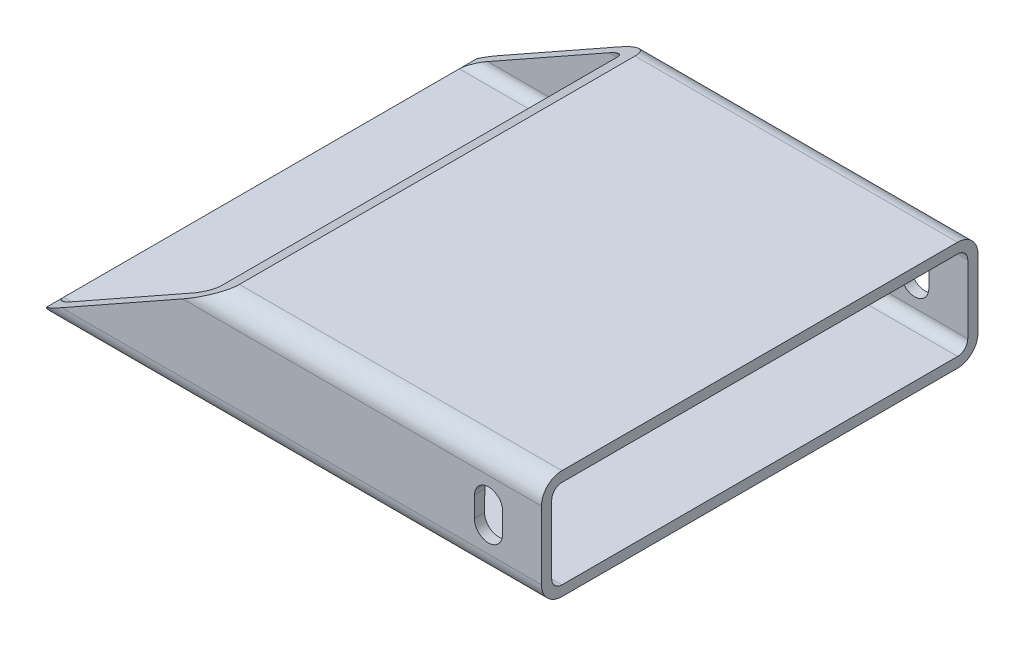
ISO-10303-21;
HEADER;
FILE_DESCRIPTION(('STEP AP214'),'2;1');
FILE_NAME('part.step','',(''),(''),'','','');
FILE_SCHEMA(('AUTOMOTIVE_DESIGN { 1 0 10303 214 1 1 1 1 }'));
ENDSEC;
DATA;
#1=APPLICATION_CONTEXT('core data for automotive mechanical design processes');
#2=APPLICATION_PROTOCOL_DEFINITION('international standard','automotive_design',2000,#1);
#3=PRODUCT_CONTEXT('',#1,'mechanical');
#4=PRODUCT('Part','Part','',(#3));
#5=PRODUCT_RELATED_PRODUCT_CATEGORY('part','',(#4));
#6=PRODUCT_DEFINITION_FORMATION('','',#4);
#7=PRODUCT_DEFINITION_CONTEXT('part definition',#1,'design');
#8=PRODUCT_DEFINITION('design','',#6,#7);
#9=PRODUCT_DEFINITION_SHAPE('','',#8);
#10=(LENGTH_UNIT() NAMED_UNIT(*) SI_UNIT(.MILLI.,.METRE.));
#11=(NAMED_UNIT(*) PLANE_ANGLE_UNIT() SI_UNIT($,.RADIAN.));
#12=(NAMED_UNIT(*) SI_UNIT($,.STERADIAN.) SOLID_ANGLE_UNIT());
#13=UNCERTAINTY_MEASURE_WITH_UNIT(LENGTH_MEASURE(1.E-05),#10,'distance_accuracy_value','');
#14=(GEOMETRIC_REPRESENTATION_CONTEXT(3) GLOBAL_UNCERTAINTY_ASSIGNED_CONTEXT((#13)) GLOBAL_UNIT_ASSIGNED_CONTEXT((#10,
#11,#12)) REPRESENTATION_CONTEXT('',''));
#15=CARTESIAN_POINT('',(0.,0.,0.));
#16=DIRECTION('',(0.,0.,1.));
#17=DIRECTION('',(1.,0.,0.));
#18=AXIS2_PLACEMENT_3D('',#15,#16,#17);
#19=CARTESIAN_POINT('',(231.918,15.875,101.6));
#20=DIRECTION('',(0.,0.,-1.));
#21=DIRECTION('',(-1.,0.,0.));
#22=AXIS2_PLACEMENT_3D('',#19,#20,#21);
#23=PLANE('',#22);
#24=DIRECTION('',(0.0106211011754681,0.999943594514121,0.));
#25=VECTOR('',#24,1.);
#26=CARTESIAN_POINT('',(213.773176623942,-4.83178298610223,101.6));
#27=LINE('',#26,#25);
#28=CARTESIAN_POINT('',(213.773176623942,-4.83178298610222,101.6));
#29=VERTEX_POINT('',#28);
#30=CARTESIAN_POINT('',(213.874342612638,4.69267975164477,101.6));
#31=VERTEX_POINT('',#30);
#32=EDGE_CURVE('E407',#29,#31,#27,.T.);
#33=ORIENTED_EDGE('',*,*,#32,.F.);
#34=CARTESIAN_POINT('',(207.225108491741,-4.7622313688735,101.6));
#35=DIRECTION('',(0.,0.,1.));
#36=DIRECTION('',(1.,0.,0.));
#37=AXIS2_PLACEMENT_3D('',#34,#35,#36);
#38=CIRCLE('',#37,6.5484375);
#39=CARTESIAN_POINT('',(200.67704035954,-4.69267975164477,101.6));
#40=VERTEX_POINT('',#39);
#41=EDGE_CURVE('E70',#40,#29,#38,.T.);
#42=ORIENTED_EDGE('',*,*,#41,.F.);
#43=DIRECTION('',(-0.0106211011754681,-0.999943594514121,0.));
#44=VECTOR('',#43,1.);
#45=CARTESIAN_POINT('',(200.67704035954,-4.69267975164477,101.6));
#46=LINE('',#45,#44);
#47=CARTESIAN_POINT('',(200.778206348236,4.83178298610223,101.6));
#48=VERTEX_POINT('',#47);
#49=EDGE_CURVE('E280',#48,#40,#46,.T.);
#50=ORIENTED_EDGE('',*,*,#49,.F.);
#51=CARTESIAN_POINT('',(207.326274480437,4.7622313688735,101.6));
#52=DIRECTION('',(0.,0.,1.));
#53=DIRECTION('',(1.,0.,0.));
#54=AXIS2_PLACEMENT_3D('',#51,#52,#53);
#55=CIRCLE('',#54,6.5484375);
#56=EDGE_CURVE('E286',#31,#48,#55,.T.);
#57=ORIENTED_EDGE('',*,*,#56,.F.);
#58=EDGE_LOOP('',(#33,#42,#50,#57));
#59=FACE_BOUND('',#58,.T.);
#60=DIRECTION('',(0.871430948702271,0.490518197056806,0.));
#61=VECTOR('',#60,1.);
#62=CARTESIAN_POINT('',(0.,-20.6375000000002,101.6));
#63=LINE('',#62,#61);
#64=CARTESIAN_POINT('',(8.46082758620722,-15.875,101.6));
#65=VERTEX_POINT('',#64);
#66=CARTESIAN_POINT('',(64.8663448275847,15.875,101.6));
#67=VERTEX_POINT('',#66);
#68=EDGE_CURVE('E432',#65,#67,#63,.T.);
#69=ORIENTED_EDGE('',*,*,#68,.F.);
#70=DIRECTION('',(-1.,0.,0.));
#71=VECTOR('',#70,1.);
#72=CARTESIAN_POINT('',(231.918,-15.875,101.6));
#73=LINE('',#72,#71);
#74=CARTESIAN_POINT('',(231.918,-15.875,101.6));
#75=VERTEX_POINT('',#74);
#76=EDGE_CURVE('E252',#75,#65,#73,.T.);
#77=ORIENTED_EDGE('',*,*,#76,.F.);
#78=DIRECTION('',(0.,-1.,0.));
#79=VECTOR('',#78,1.);
#80=CARTESIAN_POINT('',(231.918,15.875,101.6));
#81=LINE('',#80,#79);
#82=CARTESIAN_POINT('',(231.918,15.875,101.6));
#83=VERTEX_POINT('',#82);
#84=EDGE_CURVE('E360',#83,#75,#81,.T.);
#85=ORIENTED_EDGE('',*,*,#84,.F.);
#86=DIRECTION('',(-1.,0.,0.));
#87=VECTOR('',#86,1.);
#88=CARTESIAN_POINT('',(231.918,15.875,101.6));
#89=LINE('',#88,#87);
#90=EDGE_CURVE('E254',#83,#67,#89,.T.);
#91=ORIENTED_EDGE('',*,*,#90,.T.);
#92=EDGE_LOOP('',(#69,#77,#85,#91));
#93=FACE_BOUND('',#92,.T.);
#94=ADVANCED_FACE('F44',(#59,#93),#23,.F.);
#95=CARTESIAN_POINT('',(0.,15.875,92.075));
#96=DIRECTION('',(1.,0.,0.));
#97=DIRECTION('',(0.,0.,-1.));
#98=AXIS2_PLACEMENT_3D('',#95,#96,#97);
#99=PLANE('',#98);
#100=DIRECTION('',(0.,0.,1.));
#101=VECTOR('',#100,1.);
#102=CARTESIAN_POINT('',(0.,-20.6375000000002,-101.6));
#103=LINE('',#102,#101);
#104=CARTESIAN_POINT('',(0.,-20.6375000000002,-100.323891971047));
#105=VERTEX_POINT('',#104);
#106=CARTESIAN_POINT('',(3.93782229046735E-13,-20.6375,-92.075));
#107=VERTEX_POINT('',#106);
#108=EDGE_CURVE('E222',#105,#107,#103,.T.);
#109=ORIENTED_EDGE('',*,*,#108,.F.);
#110=CARTESIAN_POINT('',(0.,-15.875,-92.075));
#111=DIRECTION('',(1.,0.,0.));
#112=DIRECTION('',(0.,0.,-1.));
#113=AXIS2_PLACEMENT_3D('',#110,#111,#112);
#114=CIRCLE('',#113,9.525);
#115=CARTESIAN_POINT('',(0.,-25.4,-92.075));
#116=VERTEX_POINT('',#115);
#117=EDGE_CURVE('E358',#116,#105,#114,.T.);
#118=ORIENTED_EDGE('',*,*,#117,.F.);
#119=DIRECTION('',(0.,0.,-1.));
#120=VECTOR('',#119,1.);
#121=CARTESIAN_POINT('',(0.,-25.4,-92.075));
#122=LINE('',#121,#120);
#123=CARTESIAN_POINT('',(0.,-25.4,92.075));
#124=VERTEX_POINT('',#123);
#125=EDGE_CURVE('E375',#124,#116,#122,.T.);
#126=ORIENTED_EDGE('',*,*,#125,.F.);
#127=CARTESIAN_POINT('',(0.,-15.875,92.075));
#128=DIRECTION('',(1.,0.,0.));
#129=DIRECTION('',(0.,0.,-1.));
#130=AXIS2_PLACEMENT_3D('',#127,#128,#129);
#131=CIRCLE('',#130,9.52499999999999);
#132=CARTESIAN_POINT('',(0.,-20.6375000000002,100.323891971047));
#133=VERTEX_POINT('',#132);
#134=EDGE_CURVE('E355',#133,#124,#131,.T.);
#135=ORIENTED_EDGE('',*,*,#134,.F.);
#136=CARTESIAN_POINT('',(3.93782229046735E-13,-20.6375,92.075));
#137=VERTEX_POINT('',#136);
#138=EDGE_CURVE('E386',#137,#133,#103,.T.);
#139=ORIENTED_EDGE('',*,*,#138,.F.);
#140=DIRECTION('',(0.,0.,-1.));
#141=VECTOR('',#140,1.);
#142=CARTESIAN_POINT('',(0.,-20.6375,-92.075));
#143=LINE('',#142,#141);
#144=EDGE_CURVE('E310',#137,#107,#143,.T.);
#145=ORIENTED_EDGE('',*,*,#144,.T.);
#146=EDGE_LOOP('',(#109,#118,#126,#135,#139,#145));
#147=FACE_BOUND('',#146,.T.);
#148=ADVANCED_FACE('F383',(#147),#99,.F.);
#149=CARTESIAN_POINT('',(231.918,15.875,92.075));
#150=DIRECTION('',(1.,0.,0.));
#151=DIRECTION('',(0.,0.,-1.));
#152=AXIS2_PLACEMENT_3D('',#149,#150,#151);
#153=PLANE('',#152);
#154=CARTESIAN_POINT('',(231.918,15.875,92.075));
#155=DIRECTION('',(1.,0.,0.));
#156=DIRECTION('',(0.,0.,-1.));
#157=AXIS2_PLACEMENT_3D('',#154,#155,#156);
#158=CIRCLE('',#157,9.52499999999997);
#159=CARTESIAN_POINT('',(231.918,25.4,92.075));
#160=VERTEX_POINT('',#159);
#161=EDGE_CURVE('E353',#160,#83,#158,.T.);
#162=ORIENTED_EDGE('',*,*,#161,.T.);
#163=ORIENTED_EDGE('',*,*,#84,.T.);
#164=CARTESIAN_POINT('',(231.918,-15.875,92.075));
#165=DIRECTION('',(1.,0.,0.));
#166=DIRECTION('',(0.,0.,-1.));
#167=AXIS2_PLACEMENT_3D('',#164,#165,#166);
#168=CIRCLE('',#167,9.52499999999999);
#169=CARTESIAN_POINT('',(231.918,-25.4,92.075));
#170=VERTEX_POINT('',#169);
#171=EDGE_CURVE('E356',#75,#170,#168,.T.);
#172=ORIENTED_EDGE('',*,*,#171,.T.);
#173=DIRECTION('',(0.,0.,-1.));
#174=VECTOR('',#173,1.);
#175=CARTESIAN_POINT('',(231.918,-25.4,-92.075));
#176=LINE('',#175,#174);
#177=CARTESIAN_POINT('',(231.918,-25.4,-92.075));
#178=VERTEX_POINT('',#177);
#179=EDGE_CURVE('E362',#170,#178,#176,.T.);
#180=ORIENTED_EDGE('',*,*,#179,.T.);
#181=CARTESIAN_POINT('',(231.918,-15.875,-92.075));
#182=DIRECTION('',(1.,0.,0.));
#183=DIRECTION('',(0.,0.,-1.));
#184=AXIS2_PLACEMENT_3D('',#181,#182,#183);
#185=CIRCLE('',#184,9.525);
#186=CARTESIAN_POINT('',(231.918,-15.875,-101.6));
#187=VERTEX_POINT('',#186);
#188=EDGE_CURVE('E365',#178,#187,#185,.T.);
#189=ORIENTED_EDGE('',*,*,#188,.T.);
#190=DIRECTION('',(0.,1.,0.));
#191=VECTOR('',#190,1.);
#192=CARTESIAN_POINT('',(231.918,-15.875,-101.6));
#193=LINE('',#192,#191);
#194=CARTESIAN_POINT('',(231.918,15.875,-101.6));
#195=VERTEX_POINT('',#194);
#196=EDGE_CURVE('E368',#187,#195,#193,.T.);
#197=ORIENTED_EDGE('',*,*,#196,.T.);
#198=CARTESIAN_POINT('',(231.918,15.875,-92.075));
#199=DIRECTION('',(1.,0.,0.));
#200=DIRECTION('',(0.,0.,-1.));
#201=AXIS2_PLACEMENT_3D('',#198,#199,#200);
#202=CIRCLE('',#201,9.525);
#203=CARTESIAN_POINT('',(231.918,25.4,-92.075));
#204=VERTEX_POINT('',#203);
#205=EDGE_CURVE('E366',#195,#204,#202,.T.);
#206=ORIENTED_EDGE('',*,*,#205,.T.);
#207=DIRECTION('',(0.,0.,1.));
#208=VECTOR('',#207,1.);
#209=CARTESIAN_POINT('',(231.918,25.4,92.075));
#210=LINE('',#209,#208);
#211=EDGE_CURVE('E237',#204,#160,#210,.T.);
#212=ORIENTED_EDGE('',*,*,#211,.T.);
#213=EDGE_LOOP('',(#162,#163,#172,#180,#189,#197,#206,#212));
#214=FACE_BOUND('',#213,.T.);
#215=DIRECTION('',(0.,0.,-1.));
#216=VECTOR('',#215,1.);
#217=CARTESIAN_POINT('',(231.918,-20.6375,-92.075));
#218=LINE('',#217,#216);
#219=CARTESIAN_POINT('',(231.918,-20.6375,92.075));
#220=VERTEX_POINT('',#219);
#221=CARTESIAN_POINT('',(231.918,-20.6375,-92.075));
#222=VERTEX_POINT('',#221);
#223=EDGE_CURVE('E315',#220,#222,#218,.T.);
#224=ORIENTED_EDGE('',*,*,#223,.F.);
#225=CARTESIAN_POINT('',(231.918,-15.875,92.075));
#226=DIRECTION('',(1.,0.,0.));
#227=DIRECTION('',(0.,0.,-1.));
#228=AXIS2_PLACEMENT_3D('',#225,#226,#227);
#229=CIRCLE('',#228,4.7625);
#230=CARTESIAN_POINT('',(231.918,-15.875,96.8375));
#231=VERTEX_POINT('',#230);
#232=EDGE_CURVE('E309',#231,#220,#229,.T.);
#233=ORIENTED_EDGE('',*,*,#232,.F.);
#234=DIRECTION('',(0.,-1.,0.));
#235=VECTOR('',#234,1.);
#236=CARTESIAN_POINT('',(231.918,15.875,96.8375));
#237=LINE('',#236,#235);
#238=CARTESIAN_POINT('',(231.918,15.875,96.8375));
#239=VERTEX_POINT('',#238);
#240=EDGE_CURVE('E324',#239,#231,#237,.T.);
#241=ORIENTED_EDGE('',*,*,#240,.F.);
#242=CARTESIAN_POINT('',(231.918,15.875,92.075));
#243=DIRECTION('',(1.,0.,0.));
#244=DIRECTION('',(0.,0.,-1.));
#245=AXIS2_PLACEMENT_3D('',#242,#243,#244);
#246=CIRCLE('',#245,4.7625);
#247=CARTESIAN_POINT('',(231.918,20.6375,92.075));
#248=VERTEX_POINT('',#247);
#249=EDGE_CURVE('E325',#248,#239,#246,.T.);
#250=ORIENTED_EDGE('',*,*,#249,.F.);
#251=DIRECTION('',(0.,0.,1.));
#252=VECTOR('',#251,1.);
#253=CARTESIAN_POINT('',(231.918,20.6375,92.075));
#254=LINE('',#253,#252);
#255=CARTESIAN_POINT('',(231.918,20.6375,-92.075));
#256=VERTEX_POINT('',#255);
#257=EDGE_CURVE('E319',#256,#248,#254,.T.);
#258=ORIENTED_EDGE('',*,*,#257,.F.);
#259=CARTESIAN_POINT('',(231.918,15.875,-92.075));
#260=DIRECTION('',(1.,0.,0.));
#261=DIRECTION('',(0.,0.,-1.));
#262=AXIS2_PLACEMENT_3D('',#259,#260,#261);
#263=CIRCLE('',#262,4.7625);
#264=CARTESIAN_POINT('',(231.918,15.875,-96.8375));
#265=VERTEX_POINT('',#264);
#266=EDGE_CURVE('E318',#265,#256,#263,.T.);
#267=ORIENTED_EDGE('',*,*,#266,.F.);
#268=DIRECTION('',(0.,1.,0.));
#269=VECTOR('',#268,1.);
#270=CARTESIAN_POINT('',(231.918,-15.875,-96.8375));
#271=LINE('',#270,#269);
#272=CARTESIAN_POINT('',(231.918,-15.875,-96.8375));
#273=VERTEX_POINT('',#272);
#274=EDGE_CURVE('E316',#273,#265,#271,.T.);
#275=ORIENTED_EDGE('',*,*,#274,.F.);
#276=CARTESIAN_POINT('',(231.918,-15.875,-92.075));
#277=DIRECTION('',(1.,0.,0.));
#278=DIRECTION('',(0.,0.,-1.));
#279=AXIS2_PLACEMENT_3D('',#276,#277,#278);
#280=CIRCLE('',#279,4.7625);
#281=EDGE_CURVE('E314',#222,#273,#280,.T.);
#282=ORIENTED_EDGE('',*,*,#281,.F.);
#283=EDGE_LOOP('',(#224,#233,#241,#250,#258,#267,#275,#282));
#284=FACE_BOUND('',#283,.T.);
#285=ADVANCED_FACE('F444',(#214,#284),#153,.T.);
#286=CARTESIAN_POINT('',(231.918,15.875,92.075));
#287=DIRECTION('',(-1.,0.,0.));
#288=DIRECTION('',(0.,0.,1.));
#289=AXIS2_PLACEMENT_3D('',#286,#287,#288);
#290=CYLINDRICAL_SURFACE('',#289,9.52499999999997);
#291=DIRECTION('',(-1.,0.,0.));
#292=VECTOR('',#291,1.);
#293=CARTESIAN_POINT('',(231.918,25.4,92.075));
#294=LINE('',#293,#292);
#295=CARTESIAN_POINT('',(81.7879999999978,25.3999999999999,92.075));
#296=VERTEX_POINT('',#295);
#297=EDGE_CURVE('E240',#160,#296,#294,.T.);
#298=ORIENTED_EDGE('',*,*,#297,.T.);
#299=CARTESIAN_POINT('',(64.8663448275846,15.875,92.075));
#300=DIRECTION('',(0.490518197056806,-0.871430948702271,0.));
#301=DIRECTION('',(-0.871430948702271,-0.490518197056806,0.));
#302=AXIS2_PLACEMENT_3D('',#299,#300,#301);
#303=ELLIPSE('',#302,19.4182398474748,9.52499999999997);
#304=EDGE_CURVE('E216',#296,#67,#303,.T.);
#305=ORIENTED_EDGE('',*,*,#304,.T.);
#306=ORIENTED_EDGE('',*,*,#90,.F.);
#307=ORIENTED_EDGE('',*,*,#161,.F.);
#308=EDGE_LOOP('',(#298,#305,#306,#307));
#309=FACE_BOUND('',#308,.T.);
#310=ADVANCED_FACE('F50',(#309),#290,.T.);
#311=CARTESIAN_POINT('',(231.918,-15.875,92.075));
#312=DIRECTION('',(-1.,0.,0.));
#313=DIRECTION('',(0.,0.,1.));
#314=AXIS2_PLACEMENT_3D('',#311,#312,#313);
#315=CYLINDRICAL_SURFACE('',#314,9.52499999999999);
#316=ORIENTED_EDGE('',*,*,#76,.T.);
#317=CARTESIAN_POINT('',(8.46082758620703,-15.875,92.075));
#318=DIRECTION('',(0.490518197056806,-0.871430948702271,0.));
#319=DIRECTION('',(-0.871430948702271,-0.490518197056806,0.));
#320=AXIS2_PLACEMENT_3D('',#317,#318,#319);
#321=ELLIPSE('',#320,19.4182398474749,9.52499999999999);
#322=EDGE_CURVE('E403',#65,#133,#321,.T.);
#323=ORIENTED_EDGE('',*,*,#322,.T.);
#324=ORIENTED_EDGE('',*,*,#134,.T.);
#325=DIRECTION('',(-1.,0.,0.));
#326=VECTOR('',#325,1.);
#327=CARTESIAN_POINT('',(231.918,-25.4,92.075));
#328=LINE('',#327,#326);
#329=EDGE_CURVE('E249',#170,#124,#328,.T.);
#330=ORIENTED_EDGE('',*,*,#329,.F.);
#331=ORIENTED_EDGE('',*,*,#171,.F.);
#332=EDGE_LOOP('',(#316,#323,#324,#330,#331));
#333=FACE_BOUND('',#332,.T.);
#334=ADVANCED_FACE('F438',(#333),#315,.T.);
#335=CARTESIAN_POINT('',(231.918,-25.4,-92.075));
#336=DIRECTION('',(0.,1.,0.));
#337=DIRECTION('',(0.,0.,1.));
#338=AXIS2_PLACEMENT_3D('',#335,#336,#337);
#339=PLANE('',#338);
#340=ORIENTED_EDGE('',*,*,#125,.T.);
#341=DIRECTION('',(-1.,0.,0.));
#342=VECTOR('',#341,1.);
#343=CARTESIAN_POINT('',(231.918,-25.4,-92.075));
#344=LINE('',#343,#342);
#345=EDGE_CURVE('E247',#178,#116,#344,.T.);
#346=ORIENTED_EDGE('',*,*,#345,.F.);
#347=ORIENTED_EDGE('',*,*,#179,.F.);
#348=ORIENTED_EDGE('',*,*,#329,.T.);
#349=EDGE_LOOP('',(#340,#346,#347,#348));
#350=FACE_BOUND('',#349,.T.);
#351=ADVANCED_FACE('F455',(#350),#339,.F.);
#352=CARTESIAN_POINT('',(231.918,-15.875,-92.075));
#353=DIRECTION('',(-1.,0.,0.));
#354=DIRECTION('',(0.,0.,1.));
#355=AXIS2_PLACEMENT_3D('',#352,#353,#354);
#356=CYLINDRICAL_SURFACE('',#355,9.525);
#357=ORIENTED_EDGE('',*,*,#117,.T.);
#358=CARTESIAN_POINT('',(8.46082758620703,-15.875,-92.075));
#359=DIRECTION('',(0.490518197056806,-0.871430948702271,0.));
#360=DIRECTION('',(-0.871430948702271,-0.490518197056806,0.));
#361=AXIS2_PLACEMENT_3D('',#358,#359,#360);
#362=ELLIPSE('',#361,19.4182398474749,9.525);
#363=CARTESIAN_POINT('',(8.46082758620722,-15.875,-101.6));
#364=VERTEX_POINT('',#363);
#365=EDGE_CURVE('E235',#105,#364,#362,.T.);
#366=ORIENTED_EDGE('',*,*,#365,.T.);
#367=DIRECTION('',(-1.,0.,0.));
#368=VECTOR('',#367,1.);
#369=CARTESIAN_POINT('',(231.918,-15.875,-101.6));
#370=LINE('',#369,#368);
#371=EDGE_CURVE('E239',#187,#364,#370,.T.);
#372=ORIENTED_EDGE('',*,*,#371,.F.);
#373=ORIENTED_EDGE('',*,*,#188,.F.);
#374=ORIENTED_EDGE('',*,*,#345,.T.);
#375=EDGE_LOOP('',(#357,#366,#372,#373,#374));
#376=FACE_BOUND('',#375,.T.);
#377=ADVANCED_FACE('F380',(#376),#356,.T.);
#378=CARTESIAN_POINT('',(231.918,-15.875,-101.6));
#379=DIRECTION('',(0.,0.,1.));
#380=DIRECTION('',(1.,0.,0.));
#381=AXIS2_PLACEMENT_3D('',#378,#379,#380);
#382=PLANE('',#381);
#383=DIRECTION('',(-0.0106211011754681,-0.999943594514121,0.));
#384=VECTOR('',#383,1.);
#385=CARTESIAN_POINT('',(200.67704035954,-4.69267975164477,-101.6));
#386=LINE('',#385,#384);
#387=CARTESIAN_POINT('',(200.778206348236,4.83178298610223,-101.6));
#388=VERTEX_POINT('',#387);
#389=CARTESIAN_POINT('',(200.67704035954,-4.69267975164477,-101.6));
#390=VERTEX_POINT('',#389);
#391=EDGE_CURVE('E425',#388,#390,#386,.T.);
#392=ORIENTED_EDGE('',*,*,#391,.T.);
#393=CARTESIAN_POINT('',(207.225108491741,-4.7622313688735,-101.6));
#394=DIRECTION('',(0.,0.,1.));
#395=DIRECTION('',(1.,0.,0.));
#396=AXIS2_PLACEMENT_3D('',#393,#394,#395);
#397=CIRCLE('',#396,6.5484375);
#398=CARTESIAN_POINT('',(213.773176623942,-4.83178298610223,-101.6));
#399=VERTEX_POINT('',#398);
#400=EDGE_CURVE('E414',#390,#399,#397,.T.);
#401=ORIENTED_EDGE('',*,*,#400,.T.);
#402=DIRECTION('',(0.0106211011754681,0.999943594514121,0.));
#403=VECTOR('',#402,1.);
#404=CARTESIAN_POINT('',(213.773176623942,-4.83178298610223,-101.6));
#405=LINE('',#404,#403);
#406=CARTESIAN_POINT('',(213.874342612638,4.69267975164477,-101.6));
#407=VERTEX_POINT('',#406);
#408=EDGE_CURVE('E417',#399,#407,#405,.T.);
#409=ORIENTED_EDGE('',*,*,#408,.T.);
#410=CARTESIAN_POINT('',(207.326274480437,4.7622313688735,-101.6));
#411=DIRECTION('',(0.,0.,1.));
#412=DIRECTION('',(1.,0.,0.));
#413=AXIS2_PLACEMENT_3D('',#410,#411,#412);
#414=CIRCLE('',#413,6.5484375);
#415=EDGE_CURVE('E419',#407,#388,#414,.T.);
#416=ORIENTED_EDGE('',*,*,#415,.T.);
#417=EDGE_LOOP('',(#392,#401,#409,#416));
#418=FACE_BOUND('',#417,.T.);
#419=ORIENTED_EDGE('',*,*,#371,.T.);
#420=DIRECTION('',(0.871430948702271,0.490518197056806,0.));
#421=VECTOR('',#420,1.);
#422=CARTESIAN_POINT('',(0.,-20.6375000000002,-101.6));
#423=LINE('',#422,#421);
#424=CARTESIAN_POINT('',(64.8663448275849,15.8750000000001,-101.6));
#425=VERTEX_POINT('',#424);
#426=EDGE_CURVE('E394',#364,#425,#423,.T.);
#427=ORIENTED_EDGE('',*,*,#426,.T.);
#428=DIRECTION('',(-1.,0.,0.));
#429=VECTOR('',#428,1.);
#430=CARTESIAN_POINT('',(231.918,15.875,-101.6));
#431=LINE('',#430,#429);
#432=EDGE_CURVE('E232',#195,#425,#431,.T.);
#433=ORIENTED_EDGE('',*,*,#432,.F.);
#434=ORIENTED_EDGE('',*,*,#196,.F.);
#435=EDGE_LOOP('',(#419,#427,#433,#434));
#436=FACE_BOUND('',#435,.T.);
#437=ADVANCED_FACE('F468',(#418,#436),#382,.F.);
#438=CARTESIAN_POINT('',(231.918,15.875,-92.075));
#439=DIRECTION('',(-1.,0.,0.));
#440=DIRECTION('',(0.,0.,1.));
#441=AXIS2_PLACEMENT_3D('',#438,#439,#440);
#442=CYLINDRICAL_SURFACE('',#441,9.525);
#443=ORIENTED_EDGE('',*,*,#432,.T.);
#444=CARTESIAN_POINT('',(64.8663448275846,15.875,-92.075));
#445=DIRECTION('',(0.490518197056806,-0.871430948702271,0.));
#446=DIRECTION('',(-0.871430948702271,-0.490518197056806,0.));
#447=AXIS2_PLACEMENT_3D('',#444,#445,#446);
#448=ELLIPSE('',#447,19.4182398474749,9.525);
#449=CARTESIAN_POINT('',(81.7879999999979,25.4,-92.075));
#450=VERTEX_POINT('',#449);
#451=EDGE_CURVE('E213',#425,#450,#448,.T.);
#452=ORIENTED_EDGE('',*,*,#451,.T.);
#453=DIRECTION('',(-1.,0.,0.));
#454=VECTOR('',#453,1.);
#455=CARTESIAN_POINT('',(231.918,25.4,-92.075));
#456=LINE('',#455,#454);
#457=EDGE_CURVE('E230',#204,#450,#456,.T.);
#458=ORIENTED_EDGE('',*,*,#457,.F.);
#459=ORIENTED_EDGE('',*,*,#205,.F.);
#460=EDGE_LOOP('',(#443,#452,#458,#459));
#461=FACE_BOUND('',#460,.T.);
#462=ADVANCED_FACE('F229',(#461),#442,.T.);
#463=CARTESIAN_POINT('',(231.918,25.4,92.075));
#464=DIRECTION('',(0.,-1.,0.));
#465=DIRECTION('',(0.,0.,-1.));
#466=AXIS2_PLACEMENT_3D('',#463,#464,#465);
#467=PLANE('',#466);
#468=ORIENTED_EDGE('',*,*,#457,.T.);
#469=DIRECTION('',(0.,0.,1.));
#470=VECTOR('',#469,1.);
#471=CARTESIAN_POINT('',(81.7879999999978,25.4,-101.6));
#472=LINE('',#471,#470);
#473=EDGE_CURVE('E209',#450,#296,#472,.T.);
#474=ORIENTED_EDGE('',*,*,#473,.T.);
#475=ORIENTED_EDGE('',*,*,#297,.F.);
#476=ORIENTED_EDGE('',*,*,#211,.F.);
#477=EDGE_LOOP('',(#468,#474,#475,#476));
#478=FACE_BOUND('',#477,.T.);
#479=ADVANCED_FACE('F231',(#478),#467,.F.);
#480=CARTESIAN_POINT('',(231.918,-15.875,92.075));
#481=DIRECTION('',(-1.,0.,0.));
#482=DIRECTION('',(0.,0.,1.));
#483=AXIS2_PLACEMENT_3D('',#480,#481,#482);
#484=CYLINDRICAL_SURFACE('',#483,4.7625);
#485=CARTESIAN_POINT('',(8.46082758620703,-15.875,92.075));
#486=DIRECTION('',(0.490518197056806,-0.871430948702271,0.));
#487=DIRECTION('',(-0.871430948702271,-0.490518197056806,0.));
#488=AXIS2_PLACEMENT_3D('',#485,#486,#487);
#489=ELLIPSE('',#488,9.70911992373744,4.7625);
#490=CARTESIAN_POINT('',(8.460827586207,-15.875,96.8375));
#491=VERTEX_POINT('',#490);
#492=EDGE_CURVE('E233',#491,#137,#489,.T.);
#493=ORIENTED_EDGE('',*,*,#492,.F.);
#494=DIRECTION('',(-1.,0.,0.));
#495=VECTOR('',#494,1.);
#496=CARTESIAN_POINT('',(231.918,-15.875,96.8375));
#497=LINE('',#496,#495);
#498=EDGE_CURVE('E330',#231,#491,#497,.T.);
#499=ORIENTED_EDGE('',*,*,#498,.F.);
#500=ORIENTED_EDGE('',*,*,#232,.T.);
#501=DIRECTION('',(-1.,0.,0.));
#502=VECTOR('',#501,1.);
#503=CARTESIAN_POINT('',(231.918,-20.6375,92.075));
#504=LINE('',#503,#502);
#505=EDGE_CURVE('E348',#220,#137,#504,.T.);
#506=ORIENTED_EDGE('',*,*,#505,.T.);
#507=EDGE_LOOP('',(#493,#499,#500,#506));
#508=FACE_BOUND('',#507,.T.);
#509=ADVANCED_FACE('F464',(#508),#484,.F.);
#510=CARTESIAN_POINT('',(231.918,-20.6375,-92.075));
#511=DIRECTION('',(0.,1.,0.));
#512=DIRECTION('',(0.,0.,1.));
#513=AXIS2_PLACEMENT_3D('',#510,#511,#512);
#514=PLANE('',#513);
#515=ORIENTED_EDGE('',*,*,#144,.F.);
#516=ORIENTED_EDGE('',*,*,#505,.F.);
#517=ORIENTED_EDGE('',*,*,#223,.T.);
#518=DIRECTION('',(-1.,0.,0.));
#519=VECTOR('',#518,1.);
#520=CARTESIAN_POINT('',(231.918,-20.6375,-92.075));
#521=LINE('',#520,#519);
#522=EDGE_CURVE('E350',#222,#107,#521,.T.);
#523=ORIENTED_EDGE('',*,*,#522,.T.);
#524=EDGE_LOOP('',(#515,#516,#517,#523));
#525=FACE_BOUND('',#524,.T.);
#526=ADVANCED_FACE('F611',(#525),#514,.T.);
#527=CARTESIAN_POINT('',(231.918,-15.875,-92.075));
#528=DIRECTION('',(-1.,0.,0.));
#529=DIRECTION('',(0.,0.,1.));
#530=AXIS2_PLACEMENT_3D('',#527,#528,#529);
#531=CYLINDRICAL_SURFACE('',#530,4.7625);
#532=CARTESIAN_POINT('',(8.46082758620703,-15.875,-92.075));
#533=DIRECTION('',(0.490518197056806,-0.871430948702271,0.));
#534=DIRECTION('',(-0.871430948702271,-0.490518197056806,0.));
#535=AXIS2_PLACEMENT_3D('',#532,#533,#534);
#536=ELLIPSE('',#535,9.70911992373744,4.7625);
#537=CARTESIAN_POINT('',(8.460827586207,-15.875,-96.8375));
#538=VERTEX_POINT('',#537);
#539=EDGE_CURVE('E402',#107,#538,#536,.T.);
#540=ORIENTED_EDGE('',*,*,#539,.F.);
#541=ORIENTED_EDGE('',*,*,#522,.F.);
#542=ORIENTED_EDGE('',*,*,#281,.T.);
#543=DIRECTION('',(-1.,0.,0.));
#544=VECTOR('',#543,1.);
#545=CARTESIAN_POINT('',(231.918,-15.875,-96.8375));
#546=LINE('',#545,#544);
#547=EDGE_CURVE('E344',#273,#538,#546,.T.);
#548=ORIENTED_EDGE('',*,*,#547,.T.);
#549=EDGE_LOOP('',(#540,#541,#542,#548));
#550=FACE_BOUND('',#549,.T.);
#551=ADVANCED_FACE('F602',(#550),#531,.F.);
#552=CARTESIAN_POINT('',(231.918,-15.875,-96.8375));
#553=DIRECTION('',(0.,0.,1.));
#554=DIRECTION('',(0.,-1.,0.));
#555=AXIS2_PLACEMENT_3D('',#552,#553,#554);
#556=PLANE('',#555);
#557=DIRECTION('',(0.871430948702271,0.490518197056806,0.));
#558=VECTOR('',#557,1.);
#559=CARTESIAN_POINT('',(178.152393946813,79.6423801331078,-96.8374999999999));
#560=LINE('',#559,#558);
#561=CARTESIAN_POINT('',(64.8663448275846,15.875,-96.8375));
#562=VERTEX_POINT('',#561);
#563=EDGE_CURVE('E399',#538,#562,#560,.T.);
#564=ORIENTED_EDGE('',*,*,#563,.F.);
#565=ORIENTED_EDGE('',*,*,#547,.F.);
#566=ORIENTED_EDGE('',*,*,#274,.T.);
#567=DIRECTION('',(-1.,0.,0.));
#568=VECTOR('',#567,1.);
#569=CARTESIAN_POINT('',(231.918,15.875,-96.8375));
#570=LINE('',#569,#568);
#571=EDGE_CURVE('E342',#265,#562,#570,.T.);
#572=ORIENTED_EDGE('',*,*,#571,.T.);
#573=EDGE_LOOP('',(#564,#565,#566,#572));
#574=FACE_BOUND('',#573,.T.);
#575=CARTESIAN_POINT('',(207.225108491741,-4.7622313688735,-96.8375));
#576=DIRECTION('',(0.,0.,1.));
#577=DIRECTION('',(0.,-1.,0.));
#578=AXIS2_PLACEMENT_3D('',#575,#576,#577);
#579=CIRCLE('',#578,6.5484375);
#580=CARTESIAN_POINT('',(200.67704035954,-4.69267975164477,-96.8375));
#581=VERTEX_POINT('',#580);
#582=CARTESIAN_POINT('',(213.773176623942,-4.83178298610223,-96.8375));
#583=VERTEX_POINT('',#582);
#584=EDGE_CURVE('E308',#581,#583,#579,.T.);
#585=ORIENTED_EDGE('',*,*,#584,.F.);
#586=DIRECTION('',(-0.0106211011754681,-0.999943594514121,0.));
#587=VECTOR('',#586,1.);
#588=CARTESIAN_POINT('',(200.561802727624,-15.5419438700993,-96.8375));
#589=LINE('',#588,#587);
#590=CARTESIAN_POINT('',(200.778206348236,4.83178298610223,-96.8375));
#591=VERTEX_POINT('',#590);
#592=EDGE_CURVE('E304',#591,#581,#589,.T.);
#593=ORIENTED_EDGE('',*,*,#592,.F.);
#594=CARTESIAN_POINT('',(207.326274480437,4.7622313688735,-96.8375));
#595=DIRECTION('',(0.,0.,1.));
#596=DIRECTION('',(0.,-1.,0.));
#597=AXIS2_PLACEMENT_3D('',#594,#595,#596);
#598=CIRCLE('',#597,6.5484375);
#599=CARTESIAN_POINT('',(213.874342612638,4.69267975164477,-96.8375));
#600=VERTEX_POINT('',#599);
#601=EDGE_CURVE('E305',#600,#591,#598,.T.);
#602=ORIENTED_EDGE('',*,*,#601,.F.);
#603=DIRECTION('',(0.0106211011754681,0.999943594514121,0.));
#604=VECTOR('',#603,1.);
#605=CARTESIAN_POINT('',(213.657938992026,-15.6810471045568,-96.8375));
#606=LINE('',#605,#604);
#607=EDGE_CURVE('E297',#583,#600,#606,.T.);
#608=ORIENTED_EDGE('',*,*,#607,.F.);
#609=EDGE_LOOP('',(#585,#593,#602,#608));
#610=FACE_BOUND('',#609,.T.);
#611=ADVANCED_FACE('F592',(#574,#610),#556,.T.);
#612=CARTESIAN_POINT('',(231.918,15.875,-92.075));
#613=DIRECTION('',(-1.,0.,0.));
#614=DIRECTION('',(0.,0.,1.));
#615=AXIS2_PLACEMENT_3D('',#612,#613,#614);
#616=CYLINDRICAL_SURFACE('',#615,4.7625);
#617=CARTESIAN_POINT('',(64.8663448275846,15.875,-92.075));
#618=DIRECTION('',(0.490518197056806,-0.871430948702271,0.));
#619=DIRECTION('',(-0.871430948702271,-0.490518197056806,0.));
#620=AXIS2_PLACEMENT_3D('',#617,#618,#619);
#621=ELLIPSE('',#620,9.70911992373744,4.7625);
#622=CARTESIAN_POINT('',(73.3271724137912,20.6375,-92.075));
#623=VERTEX_POINT('',#622);
#624=EDGE_CURVE('E400',#562,#623,#621,.T.);
#625=ORIENTED_EDGE('',*,*,#624,.F.);
#626=ORIENTED_EDGE('',*,*,#571,.F.);
#627=ORIENTED_EDGE('',*,*,#266,.T.);
#628=DIRECTION('',(-1.,0.,0.));
#629=VECTOR('',#628,1.);
#630=CARTESIAN_POINT('',(231.918,20.6375,-92.075));
#631=LINE('',#630,#629);
#632=EDGE_CURVE('E340',#256,#623,#631,.T.);
#633=ORIENTED_EDGE('',*,*,#632,.T.);
#634=EDGE_LOOP('',(#625,#626,#627,#633));
#635=FACE_BOUND('',#634,.T.);
#636=ADVANCED_FACE('F584',(#635),#616,.F.);
#637=CARTESIAN_POINT('',(231.918,20.6375,92.075));
#638=DIRECTION('',(0.,-1.,0.));
#639=DIRECTION('',(0.,0.,-1.));
#640=AXIS2_PLACEMENT_3D('',#637,#638,#639);
#641=PLANE('',#640);
#642=DIRECTION('',(0.,0.,1.));
#643=VECTOR('',#642,1.);
#644=CARTESIAN_POINT('',(73.3271724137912,20.6375,92.075));
#645=LINE('',#644,#643);
#646=CARTESIAN_POINT('',(73.3271724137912,20.6375,92.075));
#647=VERTEX_POINT('',#646);
#648=EDGE_CURVE('E392',#623,#647,#645,.T.);
#649=ORIENTED_EDGE('',*,*,#648,.F.);
#650=ORIENTED_EDGE('',*,*,#632,.F.);
#651=ORIENTED_EDGE('',*,*,#257,.T.);
#652=DIRECTION('',(-1.,0.,0.));
#653=VECTOR('',#652,1.);
#654=CARTESIAN_POINT('',(231.918,20.6375,92.075));
#655=LINE('',#654,#653);
#656=EDGE_CURVE('E333',#248,#647,#655,.T.);
#657=ORIENTED_EDGE('',*,*,#656,.T.);
#658=EDGE_LOOP('',(#649,#650,#651,#657));
#659=FACE_BOUND('',#658,.T.);
#660=ADVANCED_FACE('F577',(#659),#641,.T.);
#661=CARTESIAN_POINT('',(231.918,15.875,92.075));
#662=DIRECTION('',(-1.,0.,0.));
#663=DIRECTION('',(0.,0.,1.));
#664=AXIS2_PLACEMENT_3D('',#661,#662,#663);
#665=CYLINDRICAL_SURFACE('',#664,4.7625);
#666=CARTESIAN_POINT('',(64.8663448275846,15.875,92.075));
#667=DIRECTION('',(0.490518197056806,-0.871430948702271,0.));
#668=DIRECTION('',(-0.871430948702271,-0.490518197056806,0.));
#669=AXIS2_PLACEMENT_3D('',#666,#667,#668);
#670=ELLIPSE('',#669,9.70911992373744,4.7625);
#671=CARTESIAN_POINT('',(64.8663448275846,15.875,96.8375));
#672=VERTEX_POINT('',#671);
#673=EDGE_CURVE('E56',#647,#672,#670,.T.);
#674=ORIENTED_EDGE('',*,*,#673,.F.);
#675=ORIENTED_EDGE('',*,*,#656,.F.);
#676=ORIENTED_EDGE('',*,*,#249,.T.);
#677=DIRECTION('',(-1.,0.,0.));
#678=VECTOR('',#677,1.);
#679=CARTESIAN_POINT('',(231.918,15.875,96.8375));
#680=LINE('',#679,#678);
#681=EDGE_CURVE('E335',#239,#672,#680,.T.);
#682=ORIENTED_EDGE('',*,*,#681,.T.);
#683=EDGE_LOOP('',(#674,#675,#676,#682));
#684=FACE_BOUND('',#683,.T.);
#685=ADVANCED_FACE('F570',(#684),#665,.F.);
#686=CARTESIAN_POINT('',(231.918,15.875,96.8375));
#687=DIRECTION('',(0.,0.,-1.));
#688=DIRECTION('',(-1.,0.,0.));
#689=AXIS2_PLACEMENT_3D('',#686,#687,#688);
#690=PLANE('',#689);
#691=DIRECTION('',(-0.871430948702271,-0.490518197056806,0.));
#692=VECTOR('',#691,1.);
#693=CARTESIAN_POINT('',(191.7240183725,87.2816873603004,96.8375));
#694=LINE('',#693,#692);
#695=EDGE_CURVE('E11',#672,#491,#694,.T.);
#696=ORIENTED_EDGE('',*,*,#695,.F.);
#697=ORIENTED_EDGE('',*,*,#681,.F.);
#698=ORIENTED_EDGE('',*,*,#240,.T.);
#699=ORIENTED_EDGE('',*,*,#498,.T.);
#700=EDGE_LOOP('',(#696,#697,#698,#699));
#701=FACE_BOUND('',#700,.T.);
#702=CARTESIAN_POINT('',(207.225108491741,-4.7622313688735,96.8375));
#703=DIRECTION('',(0.,0.,-1.));
#704=DIRECTION('',(-1.,0.,0.));
#705=AXIS2_PLACEMENT_3D('',#702,#703,#704);
#706=CIRCLE('',#705,6.5484375);
#707=CARTESIAN_POINT('',(213.773176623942,-4.83178298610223,96.8375));
#708=VERTEX_POINT('',#707);
#709=CARTESIAN_POINT('',(200.67704035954,-4.69267975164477,96.8375));
#710=VERTEX_POINT('',#709);
#711=EDGE_CURVE('E52',#708,#710,#706,.T.);
#712=ORIENTED_EDGE('',*,*,#711,.F.);
#713=DIRECTION('',(-0.0106211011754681,-0.999943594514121,0.));
#714=VECTOR('',#713,1.);
#715=CARTESIAN_POINT('',(213.995139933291,16.065371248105,96.8375));
#716=LINE('',#715,#714);
#717=CARTESIAN_POINT('',(213.874342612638,4.69267975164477,96.8375));
#718=VERTEX_POINT('',#717);
#719=EDGE_CURVE('E256',#718,#708,#716,.T.);
#720=ORIENTED_EDGE('',*,*,#719,.F.);
#721=CARTESIAN_POINT('',(207.326274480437,4.7622313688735,96.8375));
#722=DIRECTION('',(0.,0.,-1.));
#723=DIRECTION('',(-1.,0.,0.));
#724=AXIS2_PLACEMENT_3D('',#721,#722,#723);
#725=CIRCLE('',#724,6.5484375);
#726=CARTESIAN_POINT('',(200.778206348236,4.83178298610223,96.8375));
#727=VERTEX_POINT('',#726);
#728=EDGE_CURVE('E257',#727,#718,#725,.T.);
#729=ORIENTED_EDGE('',*,*,#728,.F.);
#730=DIRECTION('',(0.0106211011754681,0.999943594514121,0.));
#731=VECTOR('',#730,1.);
#732=CARTESIAN_POINT('',(200.899003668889,16.2044744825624,96.8375));
#733=LINE('',#732,#731);
#734=EDGE_CURVE('E263',#710,#727,#733,.T.);
#735=ORIENTED_EDGE('',*,*,#734,.F.);
#736=EDGE_LOOP('',(#712,#720,#729,#735));
#737=FACE_BOUND('',#736,.T.);
#738=ADVANCED_FACE('F281',(#701,#737),#690,.T.);
#739=CARTESIAN_POINT('',(213.773176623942,-4.83178298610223,-101.6));
#740=DIRECTION('',(0.999943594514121,-0.0106211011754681,0.));
#741=DIRECTION('',(0.0106211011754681,0.999943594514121,0.));
#742=AXIS2_PLACEMENT_3D('',#739,#740,#741);
#743=PLANE('',#742);
#744=ORIENTED_EDGE('',*,*,#719,.T.);
#745=DIRECTION('',(0.,0.,1.));
#746=VECTOR('',#745,1.);
#747=CARTESIAN_POINT('',(213.773176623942,-4.83178298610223,-101.6));
#748=LINE('',#747,#746);
#749=EDGE_CURVE('E267',#708,#29,#748,.T.);
#750=ORIENTED_EDGE('',*,*,#749,.T.);
#751=ORIENTED_EDGE('',*,*,#32,.T.);
#752=DIRECTION('',(0.,0.,1.));
#753=VECTOR('',#752,1.);
#754=CARTESIAN_POINT('',(213.874342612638,4.69267975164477,-101.6));
#755=LINE('',#754,#753);
#756=EDGE_CURVE('E287',#718,#31,#755,.T.);
#757=ORIENTED_EDGE('',*,*,#756,.F.);
#758=EDGE_LOOP('',(#744,#750,#751,#757));
#759=FACE_BOUND('',#758,.T.);
#760=ADVANCED_FACE('F428',(#759),#743,.F.);
#761=CARTESIAN_POINT('',(207.326274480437,4.7622313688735,-101.6));
#762=DIRECTION('',(0.,0.,1.));
#763=DIRECTION('',(1.,0.,0.));
#764=AXIS2_PLACEMENT_3D('',#761,#762,#763);
#765=CYLINDRICAL_SURFACE('',#764,6.5484375);
#766=ORIENTED_EDGE('',*,*,#728,.T.);
#767=ORIENTED_EDGE('',*,*,#756,.T.);
#768=ORIENTED_EDGE('',*,*,#56,.T.);
#769=DIRECTION('',(0.,0.,1.));
#770=VECTOR('',#769,1.);
#771=CARTESIAN_POINT('',(200.778206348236,4.83178298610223,-101.6));
#772=LINE('',#771,#770);
#773=EDGE_CURVE('E288',#727,#48,#772,.T.);
#774=ORIENTED_EDGE('',*,*,#773,.F.);
#775=EDGE_LOOP('',(#766,#767,#768,#774));
#776=FACE_BOUND('',#775,.T.);
#777=ADVANCED_FACE('F283',(#776),#765,.F.);
#778=CARTESIAN_POINT('',(200.67704035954,-4.69267975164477,-101.6));
#779=DIRECTION('',(-0.999943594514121,0.0106211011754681,0.));
#780=DIRECTION('',(-0.0106211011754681,-0.999943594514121,0.));
#781=AXIS2_PLACEMENT_3D('',#778,#779,#780);
#782=PLANE('',#781);
#783=ORIENTED_EDGE('',*,*,#734,.T.);
#784=ORIENTED_EDGE('',*,*,#773,.T.);
#785=ORIENTED_EDGE('',*,*,#49,.T.);
#786=DIRECTION('',(0.,0.,1.));
#787=VECTOR('',#786,1.);
#788=CARTESIAN_POINT('',(200.67704035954,-4.69267975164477,-101.6));
#789=LINE('',#788,#787);
#790=EDGE_CURVE('E270',#710,#40,#789,.T.);
#791=ORIENTED_EDGE('',*,*,#790,.F.);
#792=EDGE_LOOP('',(#783,#784,#785,#791));
#793=FACE_BOUND('',#792,.T.);
#794=ADVANCED_FACE('F273',(#793),#782,.F.);
#795=CARTESIAN_POINT('',(207.225108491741,-4.7622313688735,-101.6));
#796=DIRECTION('',(0.,0.,1.));
#797=DIRECTION('',(1.,0.,0.));
#798=AXIS2_PLACEMENT_3D('',#795,#796,#797);
#799=CYLINDRICAL_SURFACE('',#798,6.5484375);
#800=ORIENTED_EDGE('',*,*,#711,.T.);
#801=ORIENTED_EDGE('',*,*,#790,.T.);
#802=ORIENTED_EDGE('',*,*,#41,.T.);
#803=ORIENTED_EDGE('',*,*,#749,.F.);
#804=EDGE_LOOP('',(#800,#801,#802,#803));
#805=FACE_BOUND('',#804,.T.);
#806=ADVANCED_FACE('F266',(#805),#799,.F.);
#807=ORIENTED_EDGE('',*,*,#584,.T.);
#808=EDGE_CURVE('E300',#399,#583,#748,.T.);
#809=ORIENTED_EDGE('',*,*,#808,.F.);
#810=ORIENTED_EDGE('',*,*,#400,.F.);
#811=EDGE_CURVE('E279',#390,#581,#789,.T.);
#812=ORIENTED_EDGE('',*,*,#811,.T.);
#813=EDGE_LOOP('',(#807,#809,#810,#812));
#814=FACE_BOUND('',#813,.T.);
#815=ADVANCED_FACE('F515',(#814),#799,.F.);
#816=ORIENTED_EDGE('',*,*,#592,.T.);
#817=ORIENTED_EDGE('',*,*,#811,.F.);
#818=ORIENTED_EDGE('',*,*,#391,.F.);
#819=EDGE_CURVE('E276',#388,#591,#772,.T.);
#820=ORIENTED_EDGE('',*,*,#819,.T.);
#821=EDGE_LOOP('',(#816,#817,#818,#820));
#822=FACE_BOUND('',#821,.T.);
#823=ADVANCED_FACE('F502',(#822),#782,.F.);
#824=ORIENTED_EDGE('',*,*,#601,.T.);
#825=ORIENTED_EDGE('',*,*,#819,.F.);
#826=ORIENTED_EDGE('',*,*,#415,.F.);
#827=EDGE_CURVE('E292',#407,#600,#755,.T.);
#828=ORIENTED_EDGE('',*,*,#827,.T.);
#829=EDGE_LOOP('',(#824,#825,#826,#828));
#830=FACE_BOUND('',#829,.T.);
#831=ADVANCED_FACE('F500',(#830),#765,.F.);
#832=ORIENTED_EDGE('',*,*,#607,.T.);
#833=ORIENTED_EDGE('',*,*,#827,.F.);
#834=ORIENTED_EDGE('',*,*,#408,.F.);
#835=ORIENTED_EDGE('',*,*,#808,.T.);
#836=EDGE_LOOP('',(#832,#833,#834,#835));
#837=FACE_BOUND('',#836,.T.);
#838=ADVANCED_FACE('F488',(#837),#743,.F.);
#839=CARTESIAN_POINT('',(0.,-20.6375000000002,-101.6));
#840=DIRECTION('',(0.490518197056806,-0.871430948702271,0.));
#841=DIRECTION('',(0.871430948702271,0.490518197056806,0.));
#842=AXIS2_PLACEMENT_3D('',#839,#840,#841);
#843=PLANE('',#842);
#844=ORIENTED_EDGE('',*,*,#473,.F.);
#845=ORIENTED_EDGE('',*,*,#451,.F.);
#846=ORIENTED_EDGE('',*,*,#426,.F.);
#847=ORIENTED_EDGE('',*,*,#365,.F.);
#848=ORIENTED_EDGE('',*,*,#108,.T.);
#849=ORIENTED_EDGE('',*,*,#539,.T.);
#850=ORIENTED_EDGE('',*,*,#563,.T.);
#851=ORIENTED_EDGE('',*,*,#624,.T.);
#852=ORIENTED_EDGE('',*,*,#648,.T.);
#853=ORIENTED_EDGE('',*,*,#673,.T.);
#854=ORIENTED_EDGE('',*,*,#695,.T.);
#855=ORIENTED_EDGE('',*,*,#492,.T.);
#856=ORIENTED_EDGE('',*,*,#138,.T.);
#857=ORIENTED_EDGE('',*,*,#322,.F.);
#858=ORIENTED_EDGE('',*,*,#68,.T.);
#859=ORIENTED_EDGE('',*,*,#304,.F.);
#860=EDGE_LOOP('',(#844,#845,#846,#847,#848,#849,#850,#851,#852,#853,#854,#855,#856,#857,#858,#859));
#861=FACE_BOUND('',#860,.T.);
#862=ADVANCED_FACE('F215',(#861),#843,.F.);
#863=CLOSED_SHELL('',(#94,#148,#285,#310,#334,#351,#377,#437,#462,#479,#509,#526,#551,#611,#636,
#660,#685,#738,#760,#777,#794,#806,#815,#823,#831,#838,#862));
#864=MANIFOLD_SOLID_BREP('B2',#863);
#865=ADVANCED_BREP_SHAPE_REPRESENTATION('',(#18,#864),#14);
#866=SHAPE_DEFINITION_REPRESENTATION(#9,#865);
ENDSEC;
END-ISO-10303-21;
